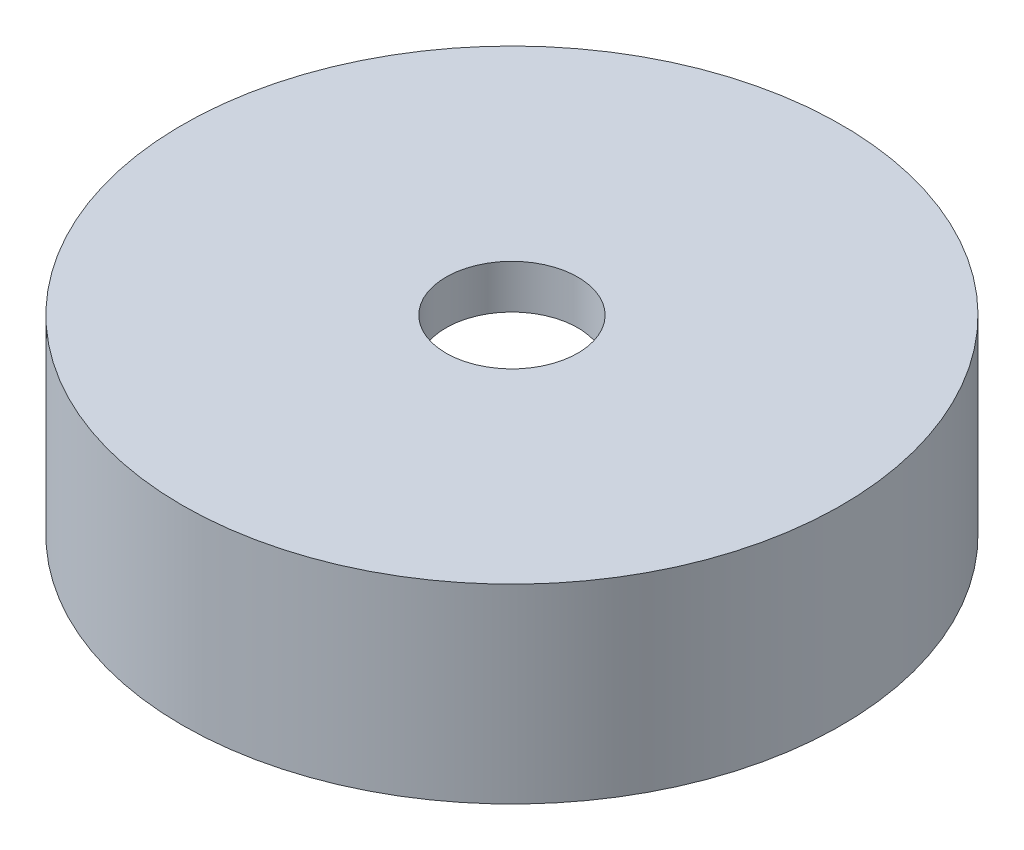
ISO-10303-21;
HEADER;
FILE_DESCRIPTION(('STEP AP214'),'2;1');
FILE_NAME('part.step','',(''),(''),'','','');
FILE_SCHEMA(('AUTOMOTIVE_DESIGN { 1 0 10303 214 1 1 1 1 }'));
ENDSEC;
DATA;
#1=APPLICATION_CONTEXT('core data for automotive mechanical design processes');
#2=APPLICATION_PROTOCOL_DEFINITION('international standard','automotive_design',2000,#1);
#3=PRODUCT_CONTEXT('',#1,'mechanical');
#4=PRODUCT('Part','Part','',(#3));
#5=PRODUCT_RELATED_PRODUCT_CATEGORY('part','',(#4));
#6=PRODUCT_DEFINITION_FORMATION('','',#4);
#7=PRODUCT_DEFINITION_CONTEXT('part definition',#1,'design');
#8=PRODUCT_DEFINITION('design','',#6,#7);
#9=PRODUCT_DEFINITION_SHAPE('','',#8);
#10=(LENGTH_UNIT() NAMED_UNIT(*) SI_UNIT(.MILLI.,.METRE.));
#11=(NAMED_UNIT(*) PLANE_ANGLE_UNIT() SI_UNIT($,.RADIAN.));
#12=(NAMED_UNIT(*) SI_UNIT($,.STERADIAN.) SOLID_ANGLE_UNIT());
#13=UNCERTAINTY_MEASURE_WITH_UNIT(LENGTH_MEASURE(1.E-05),#10,'distance_accuracy_value','');
#14=(GEOMETRIC_REPRESENTATION_CONTEXT(3) GLOBAL_UNCERTAINTY_ASSIGNED_CONTEXT((#13)) GLOBAL_UNIT_ASSIGNED_CONTEXT((#10,
#11,#12)) REPRESENTATION_CONTEXT('',''));
#15=CARTESIAN_POINT('',(0.,0.,0.));
#16=DIRECTION('',(0.,0.,1.));
#17=DIRECTION('',(1.,0.,0.));
#18=AXIS2_PLACEMENT_3D('',#15,#16,#17);
#19=CARTESIAN_POINT('',(0.,34.1841666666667,0.));
#20=DIRECTION('',(0.,1.,0.));
#21=DIRECTION('',(0.,0.,1.));
#22=AXIS2_PLACEMENT_3D('',#19,#20,#21);
#23=CYLINDRICAL_SURFACE('',#22,4.5);
#24=CARTESIAN_POINT('',(0.,9.99999999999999,0.));
#25=DIRECTION('',(0.,1.,0.));
#26=DIRECTION('',(0.,0.,1.));
#27=AXIS2_PLACEMENT_3D('',#24,#25,#26);
#28=CIRCLE('',#27,4.5);
#29=CARTESIAN_POINT('',(0.,9.99999999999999,4.5));
#30=VERTEX_POINT('',#29);
#31=EDGE_CURVE('E10',#30,#30,#28,.T.);
#32=ORIENTED_EDGE('',*,*,#31,.F.);
#33=EDGE_LOOP('',(#32));
#34=FACE_BOUND('',#33,.T.);
#35=CARTESIAN_POINT('',(0.,13.,0.));
#36=DIRECTION('',(0.,1.,0.));
#37=DIRECTION('',(0.,0.,1.));
#38=AXIS2_PLACEMENT_3D('',#35,#36,#37);
#39=CIRCLE('',#38,4.5);
#40=CARTESIAN_POINT('',(0.,13.,4.5));
#41=VERTEX_POINT('',#40);
#42=EDGE_CURVE('E53',#41,#41,#39,.T.);
#43=ORIENTED_EDGE('',*,*,#42,.T.);
#44=EDGE_LOOP('',(#43));
#45=FACE_BOUND('',#44,.T.);
#46=ADVANCED_FACE('F31',(#34,#45),#23,.F.);
#47=CARTESIAN_POINT('',(19.5,9.99999999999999,0.));
#48=DIRECTION('',(0.,1.,0.));
#49=DIRECTION('',(0.,0.,1.));
#50=AXIS2_PLACEMENT_3D('',#47,#48,#49);
#51=PLANE('',#50);
#52=CARTESIAN_POINT('',(0.,9.99999999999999,0.));
#53=DIRECTION('',(0.,1.,0.));
#54=DIRECTION('',(0.,0.,1.));
#55=AXIS2_PLACEMENT_3D('',#52,#53,#54);
#56=CIRCLE('',#55,19.5);
#57=CARTESIAN_POINT('',(0.,9.99999999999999,19.5));
#58=VERTEX_POINT('',#57);
#59=EDGE_CURVE('E37',#58,#58,#56,.T.);
#60=ORIENTED_EDGE('',*,*,#59,.F.);
#61=EDGE_LOOP('',(#60));
#62=FACE_BOUND('',#61,.T.);
#63=ORIENTED_EDGE('',*,*,#31,.T.);
#64=EDGE_LOOP('',(#63));
#65=FACE_BOUND('',#64,.T.);
#66=ADVANCED_FACE('F78',(#62,#65),#51,.F.);
#67=CARTESIAN_POINT('',(0.,34.1841666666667,0.));
#68=DIRECTION('',(0.,1.,0.));
#69=DIRECTION('',(0.,0.,1.));
#70=AXIS2_PLACEMENT_3D('',#67,#68,#69);
#71=CYLINDRICAL_SURFACE('',#70,19.5);
#72=CARTESIAN_POINT('',(0.,0.,0.));
#73=DIRECTION('',(0.,1.,0.));
#74=DIRECTION('',(0.,0.,1.));
#75=AXIS2_PLACEMENT_3D('',#72,#73,#74);
#76=CIRCLE('',#75,19.5);
#77=CARTESIAN_POINT('',(0.,0.,19.5));
#78=VERTEX_POINT('',#77);
#79=EDGE_CURVE('E41',#78,#78,#76,.T.);
#80=ORIENTED_EDGE('',*,*,#79,.F.);
#81=EDGE_LOOP('',(#80));
#82=FACE_BOUND('',#81,.T.);
#83=ORIENTED_EDGE('',*,*,#59,.T.);
#84=EDGE_LOOP('',(#83));
#85=FACE_BOUND('',#84,.T.);
#86=ADVANCED_FACE('F73',(#82,#85),#71,.F.);
#87=CARTESIAN_POINT('',(22.5,0.,0.));
#88=DIRECTION('',(0.,1.,0.));
#89=DIRECTION('',(0.,0.,1.));
#90=AXIS2_PLACEMENT_3D('',#87,#88,#89);
#91=PLANE('',#90);
#92=CARTESIAN_POINT('',(0.,0.,0.));
#93=DIRECTION('',(0.,1.,0.));
#94=DIRECTION('',(0.,0.,1.));
#95=AXIS2_PLACEMENT_3D('',#92,#93,#94);
#96=CIRCLE('',#95,22.5);
#97=CARTESIAN_POINT('',(0.,0.,22.5));
#98=VERTEX_POINT('',#97);
#99=EDGE_CURVE('E45',#98,#98,#96,.T.);
#100=ORIENTED_EDGE('',*,*,#99,.F.);
#101=EDGE_LOOP('',(#100));
#102=FACE_BOUND('',#101,.T.);
#103=ORIENTED_EDGE('',*,*,#79,.T.);
#104=EDGE_LOOP('',(#103));
#105=FACE_BOUND('',#104,.T.);
#106=ADVANCED_FACE('F67',(#102,#105),#91,.F.);
#107=CARTESIAN_POINT('',(0.,34.1841666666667,0.));
#108=DIRECTION('',(0.,1.,0.));
#109=DIRECTION('',(0.,0.,1.));
#110=AXIS2_PLACEMENT_3D('',#107,#108,#109);
#111=CYLINDRICAL_SURFACE('',#110,22.5);
#112=CARTESIAN_POINT('',(0.,13.,0.));
#113=DIRECTION('',(0.,1.,0.));
#114=DIRECTION('',(0.,0.,1.));
#115=AXIS2_PLACEMENT_3D('',#112,#113,#114);
#116=CIRCLE('',#115,22.5);
#117=CARTESIAN_POINT('',(0.,13.,22.5));
#118=VERTEX_POINT('',#117);
#119=EDGE_CURVE('E50',#118,#118,#116,.T.);
#120=ORIENTED_EDGE('',*,*,#119,.F.);
#121=EDGE_LOOP('',(#120));
#122=FACE_BOUND('',#121,.T.);
#123=ORIENTED_EDGE('',*,*,#99,.T.);
#124=EDGE_LOOP('',(#123));
#125=FACE_BOUND('',#124,.T.);
#126=ADVANCED_FACE('F61',(#122,#125),#111,.T.);
#127=CARTESIAN_POINT('',(4.5,13.,0.));
#128=DIRECTION('',(0.,-1.,0.));
#129=DIRECTION('',(0.,0.,-1.));
#130=AXIS2_PLACEMENT_3D('',#127,#128,#129);
#131=PLANE('',#130);
#132=ORIENTED_EDGE('',*,*,#42,.F.);
#133=EDGE_LOOP('',(#132));
#134=FACE_BOUND('',#133,.T.);
#135=ORIENTED_EDGE('',*,*,#119,.T.);
#136=EDGE_LOOP('',(#135));
#137=FACE_BOUND('',#136,.T.);
#138=ADVANCED_FACE('F58',(#134,#137),#131,.F.);
#139=CLOSED_SHELL('',(#46,#66,#86,#106,#126,#138));
#140=MANIFOLD_SOLID_BREP('B2',#139);
#141=ADVANCED_BREP_SHAPE_REPRESENTATION('',(#18,#140),#14);
#142=SHAPE_DEFINITION_REPRESENTATION(#9,#141);
ENDSEC;
END-ISO-10303-21;
